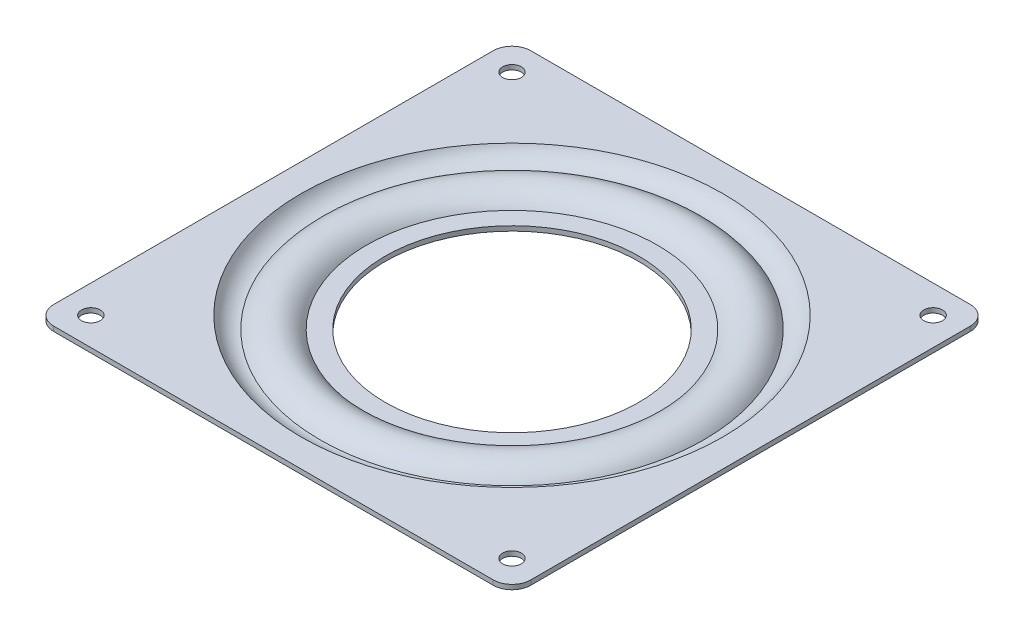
from build123d import *

# Parameters (mm, degrees)
SKETCH_2_R      = 1.985
SKETCH_2_R_2    = 44.910539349
EXTRUDE_1_DEPTH = 1


with BuildPart() as part:
    # Sketch 1 → Revolve 1 (revolve)
    with BuildSketch(Plane.XY, mode=Mode.PRIVATE) as revolve_1_sk:
        with BuildLine():
            ThreePointArc((-45.813874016, -0.428936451), (-43.539426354, -2.86488143), (-40.275857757, -3.540203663))
            ThreePointArc((-40.275857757, -3.540203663), (-35.905809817, -1.000028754), (-31.553091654, -3.569785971))
            Line((-31.553091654, -3.569785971), (-27, -3.569785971))
            Line((-27, -3.569785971), (-27, -2.569785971))
            Line((-27, -2.569785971), (-31, -2.569785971))
            ThreePointArc((-31, -2.569785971), (-35.922766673, 0), (-40.845533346, -2.569785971))
            ThreePointArc((-40.845533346, -2.569785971), (-43.250116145, -1.873465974), (-44.910539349, 0))
            Line((-44.910539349, 0), (-45.813874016, -0.428936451))
        make_face()
    revolve(revolve_1_sk.sketch.rotate(Axis((0, 6.917160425, 0), (0, -1, 0)), 270), axis=Axis((0, 6.917160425, 0), (0, -1, 0)))

    # Sketch 2 → Extrude 1 (add)
    with BuildSketch(Plane(origin=(0, 0, 0), x_dir=(1, 0, 0), z_dir=(0, 1, 0))):
        with BuildLine():
            Line((46.8, 50.8), (-46.8, 50.8))
            ThreePointArc((-46.8, 50.8), (-49.628427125, 49.628427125), (-50.8, 46.8))
            Line((-50.8, 46.8), (-50.8, -46.8))
            ThreePointArc((-50.8, -46.8), (-49.628427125, -49.628427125), (-46.8, -50.8))
            Line((-46.8, -50.8), (46.8, -50.8))
            ThreePointArc((46.8, -50.8), (49.628427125, -49.628427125), (50.8, -46.8))
            Line((50.8, -46.8), (50.8, 46.8))
            ThreePointArc((50.8, 46.8), (49.628427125, 49.628427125), (46.8, 50.8))
        make_face()
        with Locations(Location((-44.845, -44.845, 0), (0, 0, 270))):
            Circle(SKETCH_2_R, mode=Mode.SUBTRACT)
        with Locations(Location((44.845, -44.845, 0), (0, 0, 270))):
            Circle(SKETCH_2_R, mode=Mode.SUBTRACT)
        Circle(SKETCH_2_R_2, mode=Mode.SUBTRACT)
        with Locations(Location((-44.845, 44.845, 0), (0, 0, 270))):
            Circle(SKETCH_2_R, mode=Mode.SUBTRACT)
        with Locations(Location((44.845, 44.845, 0), (0, 0, 270))):
            Circle(SKETCH_2_R, mode=Mode.SUBTRACT)
    extrude(amount=-EXTRUDE_1_DEPTH)


solid = part.part
